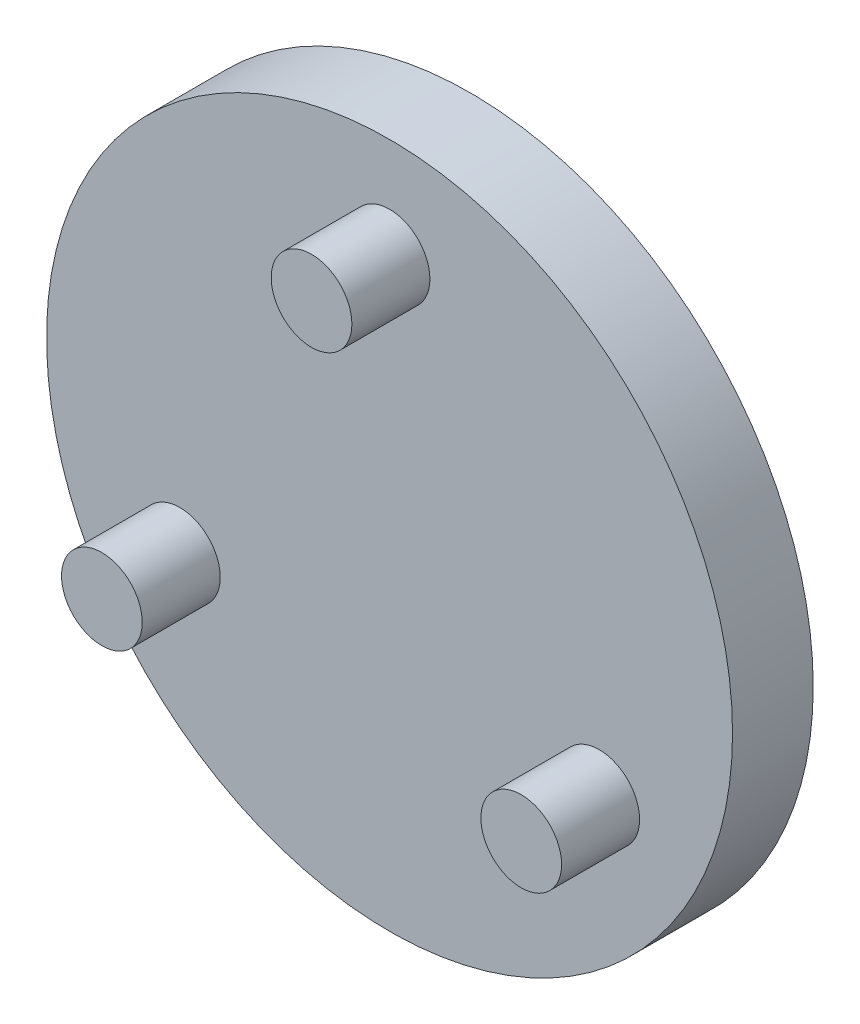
from build123d import *

# Parameters (mm, degrees)
ESQUISSE1_R      = 12.75
EXTRUSION1_DEPTH = 3
ESQUISSE2_R      = 1.5
EXTRUSION2_DEPTH = 2.9
ESQUISSE3_R      = 1.5
EXTRUSION3_DEPTH = 2.9


with BuildPart() as part:
    # Esquisse1 → Extrusion1 (new body)
    with BuildSketch(Plane.XY):
        Circle(ESQUISSE1_R)
    extrude(amount=EXTRUSION1_DEPTH)

    # Esquisse2 → Extrusion2 (add)
    with BuildSketch(Plane.XY.offset(3)):
        with Locations((0, 9)):
            Circle(ESQUISSE2_R)
        with Locations((7.794228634, -4.5)):
            Circle(ESQUISSE2_R)
        with Locations((-7.794228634, -4.5)):
            Circle(ESQUISSE2_R)
    extrude(amount=EXTRUSION2_DEPTH)

    # Esquisse3 → Extrusion3 (add)
    with BuildSketch(Plane(origin=(0, 0, 0), x_dir=(-1, 0, 0), z_dir=(0, 0, -1))):
        with Locations(Location((0, 0, 0), (0, 0, 180))):
            Circle(ESQUISSE3_R)
    extrude(amount=EXTRUSION3_DEPTH)


solid = part.part
